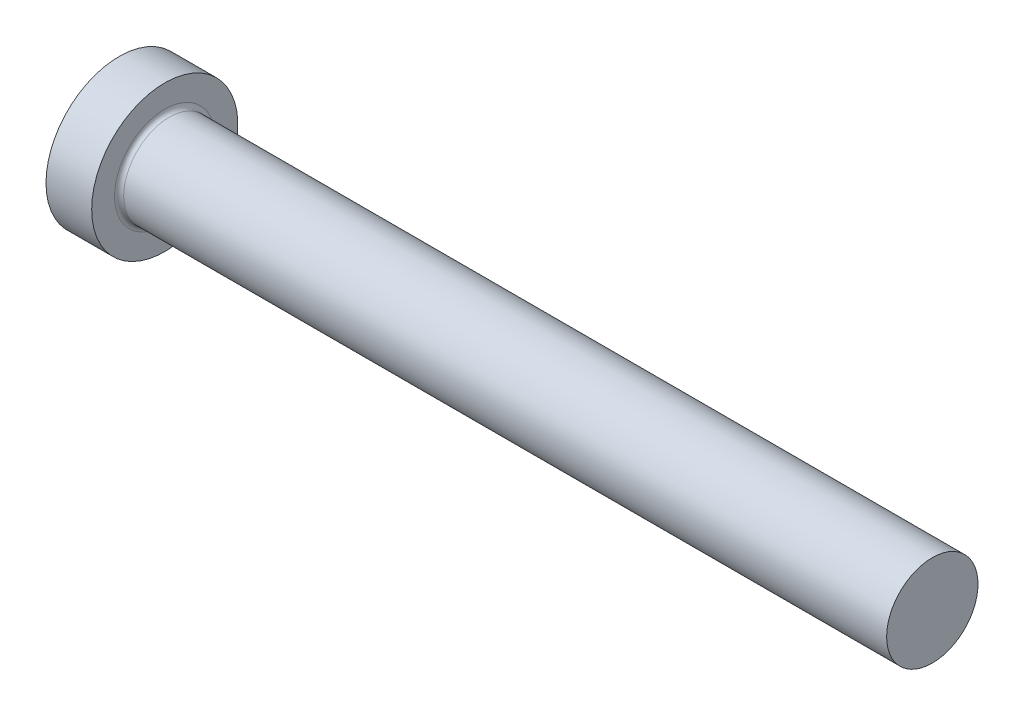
ISO-10303-21;
HEADER;
FILE_DESCRIPTION(('STEP AP214'),'2;1');
FILE_NAME('part.step','',(''),(''),'','','');
FILE_SCHEMA(('AUTOMOTIVE_DESIGN { 1 0 10303 214 1 1 1 1 }'));
ENDSEC;
DATA;
#1=APPLICATION_CONTEXT('core data for automotive mechanical design processes');
#2=APPLICATION_PROTOCOL_DEFINITION('international standard','automotive_design',2000,#1);
#3=PRODUCT_CONTEXT('',#1,'mechanical');
#4=PRODUCT('Part','Part','',(#3));
#5=PRODUCT_RELATED_PRODUCT_CATEGORY('part','',(#4));
#6=PRODUCT_DEFINITION_FORMATION('','',#4);
#7=PRODUCT_DEFINITION_CONTEXT('part definition',#1,'design');
#8=PRODUCT_DEFINITION('design','',#6,#7);
#9=PRODUCT_DEFINITION_SHAPE('','',#8);
#10=(LENGTH_UNIT() NAMED_UNIT(*) SI_UNIT(.MILLI.,.METRE.));
#11=(NAMED_UNIT(*) PLANE_ANGLE_UNIT() SI_UNIT($,.RADIAN.));
#12=(NAMED_UNIT(*) SI_UNIT($,.STERADIAN.) SOLID_ANGLE_UNIT());
#13=UNCERTAINTY_MEASURE_WITH_UNIT(LENGTH_MEASURE(1.E-05),#10,'distance_accuracy_value','');
#14=(GEOMETRIC_REPRESENTATION_CONTEXT(3) GLOBAL_UNCERTAINTY_ASSIGNED_CONTEXT((#13)) GLOBAL_UNIT_ASSIGNED_CONTEXT((#10,
#11,#12)) REPRESENTATION_CONTEXT('',''));
#15=CARTESIAN_POINT('',(0.,0.,0.));
#16=DIRECTION('',(0.,0.,1.));
#17=DIRECTION('',(1.,0.,0.));
#18=AXIS2_PLACEMENT_3D('',#15,#16,#17);
#19=CARTESIAN_POINT('',(0.,0.,0.));
#20=DIRECTION('',(-1.,0.,0.));
#21=DIRECTION('',(0.,0.,1.));
#22=AXIS2_PLACEMENT_3D('',#19,#20,#21);
#23=CYLINDRICAL_SURFACE('',#22,5.);
#24=CARTESIAN_POINT('',(5.50000000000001,0.,0.));
#25=DIRECTION('',(-1.,0.,0.));
#26=DIRECTION('',(0.,0.,1.));
#27=AXIS2_PLACEMENT_3D('',#24,#25,#26);
#28=CIRCLE('',#27,5.);
#29=CARTESIAN_POINT('',(5.50000000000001,0.,4.99999999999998));
#30=VERTEX_POINT('',#29);
#31=EDGE_CURVE('E41',#30,#30,#28,.T.);
#32=ORIENTED_EDGE('',*,*,#31,.F.);
#33=EDGE_LOOP('',(#32));
#34=FACE_BOUND('',#33,.T.);
#35=CARTESIAN_POINT('',(89.,0.,0.));
#36=DIRECTION('',(1.,0.,0.));
#37=DIRECTION('',(0.,0.,-1.));
#38=AXIS2_PLACEMENT_3D('',#35,#36,#37);
#39=CIRCLE('',#38,5.);
#40=CARTESIAN_POINT('',(89.,0.,-5.00000000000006));
#41=VERTEX_POINT('',#40);
#42=EDGE_CURVE('E46',#41,#41,#39,.T.);
#43=ORIENTED_EDGE('',*,*,#42,.F.);
#44=EDGE_LOOP('',(#43));
#45=FACE_BOUND('',#44,.T.);
#46=ADVANCED_FACE('F26',(#34,#45),#23,.T.);
#47=CARTESIAN_POINT('',(0.,0.,0.));
#48=DIRECTION('',(-1.,0.,0.));
#49=DIRECTION('',(0.,0.,1.));
#50=AXIS2_PLACEMENT_3D('',#47,#48,#49);
#51=PLANE('',#50);
#52=CARTESIAN_POINT('',(0.,0.,0.));
#53=DIRECTION('',(-1.,0.,0.));
#54=DIRECTION('',(0.,0.,1.));
#55=AXIS2_PLACEMENT_3D('',#52,#53,#54);
#56=CIRCLE('',#55,8.);
#57=CARTESIAN_POINT('',(0.,0.,7.99999999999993));
#58=VERTEX_POINT('',#57);
#59=EDGE_CURVE('E10',#58,#58,#56,.T.);
#60=ORIENTED_EDGE('',*,*,#59,.T.);
#61=EDGE_LOOP('',(#60));
#62=FACE_BOUND('',#61,.T.);
#63=ADVANCED_FACE('F28',(#62),#51,.T.);
#64=CARTESIAN_POINT('',(0.,0.,0.));
#65=DIRECTION('',(-1.,0.,0.));
#66=DIRECTION('',(0.,0.,1.));
#67=AXIS2_PLACEMENT_3D('',#64,#65,#66);
#68=CYLINDRICAL_SURFACE('',#67,8.);
#69=CARTESIAN_POINT('',(5.,0.,0.));
#70=DIRECTION('',(-1.,0.,0.));
#71=DIRECTION('',(0.,0.,1.));
#72=AXIS2_PLACEMENT_3D('',#69,#70,#71);
#73=CIRCLE('',#72,8.);
#74=CARTESIAN_POINT('',(5.,0.,7.99999999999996));
#75=VERTEX_POINT('',#74);
#76=EDGE_CURVE('E33',#75,#75,#73,.T.);
#77=ORIENTED_EDGE('',*,*,#76,.T.);
#78=EDGE_LOOP('',(#77));
#79=FACE_BOUND('',#78,.T.);
#80=ORIENTED_EDGE('',*,*,#59,.F.);
#81=EDGE_LOOP('',(#80));
#82=FACE_BOUND('',#81,.T.);
#83=ADVANCED_FACE('F58',(#79,#82),#68,.T.);
#84=CARTESIAN_POINT('',(5.,8.00000000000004,0.));
#85=DIRECTION('',(1.,0.,0.));
#86=DIRECTION('',(0.,0.,-1.));
#87=AXIS2_PLACEMENT_3D('',#84,#85,#86);
#88=PLANE('',#87);
#89=CARTESIAN_POINT('',(5.,0.,0.));
#90=DIRECTION('',(-1.,0.,0.));
#91=DIRECTION('',(0.,0.,1.));
#92=AXIS2_PLACEMENT_3D('',#89,#90,#91);
#93=CIRCLE('',#92,5.5);
#94=CARTESIAN_POINT('',(5.,0.,5.49999999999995));
#95=VERTEX_POINT('',#94);
#96=EDGE_CURVE('E37',#95,#95,#93,.T.);
#97=ORIENTED_EDGE('',*,*,#96,.T.);
#98=EDGE_LOOP('',(#97));
#99=FACE_BOUND('',#98,.T.);
#100=ORIENTED_EDGE('',*,*,#76,.F.);
#101=EDGE_LOOP('',(#100));
#102=FACE_BOUND('',#101,.T.);
#103=ADVANCED_FACE('F65',(#99,#102),#88,.T.);
#104=CARTESIAN_POINT('',(5.50000000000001,0.,0.));
#105=DIRECTION('',(-1.,0.,0.));
#106=DIRECTION('',(0.,0.,1.));
#107=AXIS2_PLACEMENT_3D('',#104,#105,#106);
#108=TOROIDAL_SURFACE('',#107,5.5,0.5);
#109=ORIENTED_EDGE('',*,*,#31,.T.);
#110=EDGE_LOOP('',(#109));
#111=FACE_BOUND('',#110,.T.);
#112=ORIENTED_EDGE('',*,*,#96,.F.);
#113=EDGE_LOOP('',(#112));
#114=FACE_BOUND('',#113,.T.);
#115=ADVANCED_FACE('F62',(#111,#114),#108,.F.);
#116=CARTESIAN_POINT('',(89.,0.,0.));
#117=DIRECTION('',(1.,0.,0.));
#118=DIRECTION('',(0.,0.,-1.));
#119=AXIS2_PLACEMENT_3D('',#116,#117,#118);
#120=PLANE('',#119);
#121=ORIENTED_EDGE('',*,*,#42,.T.);
#122=EDGE_LOOP('',(#121));
#123=FACE_BOUND('',#122,.T.);
#124=ADVANCED_FACE('F50',(#123),#120,.T.);
#125=CLOSED_SHELL('',(#46,#63,#83,#103,#115,#124));
#126=MANIFOLD_SOLID_BREP('B2',#125);
#127=ADVANCED_BREP_SHAPE_REPRESENTATION('',(#18,#126),#14);
#128=SHAPE_DEFINITION_REPRESENTATION(#9,#127);
ENDSEC;
END-ISO-10303-21;
